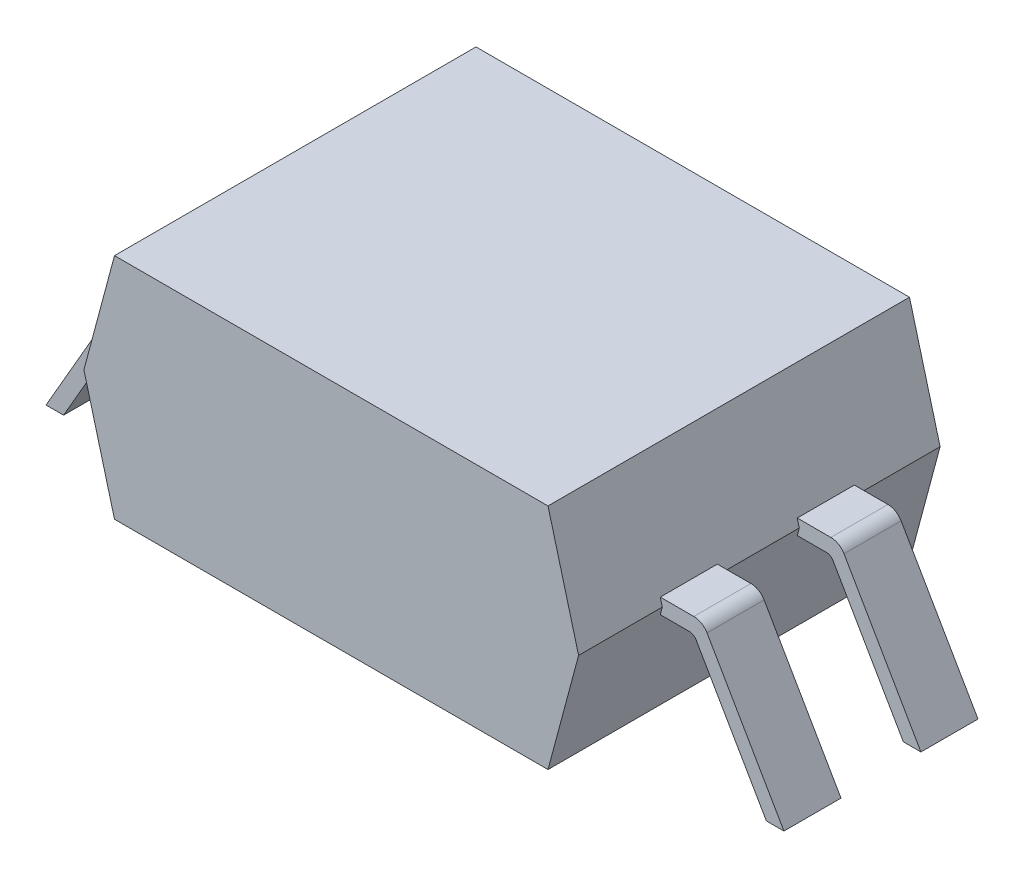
ISO-10303-21;
HEADER;
FILE_DESCRIPTION(('STEP AP214'),'2;1');
FILE_NAME('part.step','',(''),(''),'','','');
FILE_SCHEMA(('AUTOMOTIVE_DESIGN { 1 0 10303 214 1 1 1 1 }'));
ENDSEC;
DATA;
#1=APPLICATION_CONTEXT('core data for automotive mechanical design processes');
#2=APPLICATION_PROTOCOL_DEFINITION('international standard','automotive_design',2000,#1);
#3=PRODUCT_CONTEXT('',#1,'mechanical');
#4=PRODUCT('Part','Part','',(#3));
#5=PRODUCT_RELATED_PRODUCT_CATEGORY('part','',(#4));
#6=PRODUCT_DEFINITION_FORMATION('','',#4);
#7=PRODUCT_DEFINITION_CONTEXT('part definition',#1,'design');
#8=PRODUCT_DEFINITION('design','',#6,#7);
#9=PRODUCT_DEFINITION_SHAPE('','',#8);
#10=(LENGTH_UNIT() NAMED_UNIT(*) SI_UNIT(.MILLI.,.METRE.));
#11=(NAMED_UNIT(*) PLANE_ANGLE_UNIT() SI_UNIT($,.RADIAN.));
#12=(NAMED_UNIT(*) SI_UNIT($,.STERADIAN.) SOLID_ANGLE_UNIT());
#13=UNCERTAINTY_MEASURE_WITH_UNIT(LENGTH_MEASURE(1.E-05),#10,'distance_accuracy_value','');
#14=(GEOMETRIC_REPRESENTATION_CONTEXT(3) GLOBAL_UNCERTAINTY_ASSIGNED_CONTEXT((#13)) GLOBAL_UNIT_ASSIGNED_CONTEXT((#10,
#11,#12)) REPRESENTATION_CONTEXT('',''));
#15=CARTESIAN_POINT('',(0.,0.,0.));
#16=DIRECTION('',(0.,0.,1.));
#17=DIRECTION('',(1.,0.,0.));
#18=AXIS2_PLACEMENT_3D('',#15,#16,#17);
#19=CARTESIAN_POINT('',(-2.84807621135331,-1.50000000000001,2.375));
#20=DIRECTION('',(0.965925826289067,0.258819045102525,0.));
#21=DIRECTION('',(-0.258819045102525,0.965925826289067,0.));
#22=AXIS2_PLACEMENT_3D('',#19,#20,#21);
#23=PLANE('',#22);
#24=DIRECTION('',(0.,0.,1.));
#25=VECTOR('',#24,1.);
#26=CARTESIAN_POINT('',(-3.22320508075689,-0.1,-1.275));
#27=LINE('',#26,#25);
#28=CARTESIAN_POINT('',(-3.22320508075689,-0.1,-1.275));
#29=VERTEX_POINT('',#28);
#30=CARTESIAN_POINT('',(-3.22320508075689,-0.100000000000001,-0.525));
#31=VERTEX_POINT('',#30);
#32=EDGE_CURVE('E35',#29,#31,#27,.T.);
#33=ORIENTED_EDGE('',*,*,#32,.F.);
#34=DIRECTION('',(-0.258819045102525,0.965925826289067,0.));
#35=VECTOR('',#34,1.);
#36=CARTESIAN_POINT('',(-2.84807621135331,-1.50000000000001,-1.275));
#37=LINE('',#36,#35);
#38=CARTESIAN_POINT('',(-3.25,0.,-1.275));
#39=VERTEX_POINT('',#38);
#40=EDGE_CURVE('E11',#29,#39,#37,.T.);
#41=ORIENTED_EDGE('',*,*,#40,.T.);
#42=DIRECTION('',(0.,0.,-1.));
#43=VECTOR('',#42,1.);
#44=CARTESIAN_POINT('',(-3.25,0.,2.375));
#45=LINE('',#44,#43);
#46=CARTESIAN_POINT('',(-3.25,0.,-2.375));
#47=VERTEX_POINT('',#46);
#48=EDGE_CURVE('E27',#39,#47,#45,.T.);
#49=ORIENTED_EDGE('',*,*,#48,.T.);
#50=DIRECTION('',(0.258819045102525,-0.965925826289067,0.));
#51=VECTOR('',#50,1.);
#52=CARTESIAN_POINT('',(-2.84807621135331,-1.50000000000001,-2.375));
#53=LINE('',#52,#51);
#54=CARTESIAN_POINT('',(-2.84807621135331,-1.50000000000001,-2.375));
#55=VERTEX_POINT('',#54);
#56=EDGE_CURVE('E621',#47,#55,#53,.T.);
#57=ORIENTED_EDGE('',*,*,#56,.T.);
#58=DIRECTION('',(0.,0.,-1.));
#59=VECTOR('',#58,1.);
#60=CARTESIAN_POINT('',(-2.84807621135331,-1.50000000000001,2.375));
#61=LINE('',#60,#59);
#62=CARTESIAN_POINT('',(-2.84807621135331,-1.50000000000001,2.375));
#63=VERTEX_POINT('',#62);
#64=EDGE_CURVE('E600',#63,#55,#61,.T.);
#65=ORIENTED_EDGE('',*,*,#64,.F.);
#66=DIRECTION('',(0.258819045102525,-0.965925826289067,0.));
#67=VECTOR('',#66,1.);
#68=CARTESIAN_POINT('',(-2.84807621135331,-1.50000000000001,2.375));
#69=LINE('',#68,#67);
#70=CARTESIAN_POINT('',(-3.25,0.,2.375));
#71=VERTEX_POINT('',#70);
#72=EDGE_CURVE('E533',#71,#63,#69,.T.);
#73=ORIENTED_EDGE('',*,*,#72,.F.);
#74=DIRECTION('',(0.,0.,-1.));
#75=VECTOR('',#74,1.);
#76=CARTESIAN_POINT('',(-3.25,0.,2.375));
#77=LINE('',#76,#75);
#78=CARTESIAN_POINT('',(-3.25,0.,1.275));
#79=VERTEX_POINT('',#78);
#80=EDGE_CURVE('E618',#71,#79,#77,.T.);
#81=ORIENTED_EDGE('',*,*,#80,.T.);
#82=DIRECTION('',(0.258819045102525,-0.965925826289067,0.));
#83=VECTOR('',#82,1.);
#84=CARTESIAN_POINT('',(-2.84807621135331,-1.50000000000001,1.275));
#85=LINE('',#84,#83);
#86=CARTESIAN_POINT('',(-3.22320508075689,-0.1,1.275));
#87=VERTEX_POINT('',#86);
#88=EDGE_CURVE('E615',#79,#87,#85,.T.);
#89=ORIENTED_EDGE('',*,*,#88,.T.);
#90=DIRECTION('',(0.,0.,-1.));
#91=VECTOR('',#90,1.);
#92=CARTESIAN_POINT('',(-3.22320508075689,-0.1,1.275));
#93=LINE('',#92,#91);
#94=CARTESIAN_POINT('',(-3.22320508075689,-0.100000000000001,0.525));
#95=VERTEX_POINT('',#94);
#96=EDGE_CURVE('E611',#87,#95,#93,.T.);
#97=ORIENTED_EDGE('',*,*,#96,.T.);
#98=DIRECTION('',(0.258819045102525,-0.965925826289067,0.));
#99=VECTOR('',#98,1.);
#100=CARTESIAN_POINT('',(-2.84807621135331,-1.50000000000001,0.525));
#101=LINE('',#100,#99);
#102=CARTESIAN_POINT('',(-3.25,0.,0.525));
#103=VERTEX_POINT('',#102);
#104=EDGE_CURVE('E497',#103,#95,#101,.T.);
#105=ORIENTED_EDGE('',*,*,#104,.F.);
#106=DIRECTION('',(0.,0.,-1.));
#107=VECTOR('',#106,1.);
#108=CARTESIAN_POINT('',(-3.25,0.,2.375));
#109=LINE('',#108,#107);
#110=CARTESIAN_POINT('',(-3.25,0.,-0.525));
#111=VERTEX_POINT('',#110);
#112=EDGE_CURVE('E607',#103,#111,#109,.T.);
#113=ORIENTED_EDGE('',*,*,#112,.T.);
#114=DIRECTION('',(-0.258819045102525,0.965925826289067,0.));
#115=VECTOR('',#114,1.);
#116=CARTESIAN_POINT('',(-2.84807621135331,-1.50000000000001,-0.525));
#117=LINE('',#116,#115);
#118=EDGE_CURVE('E437',#31,#111,#117,.T.);
#119=ORIENTED_EDGE('',*,*,#118,.F.);
#120=EDGE_LOOP('',(#33,#41,#49,#57,#65,#73,#81,#89,#97,#105,#113,#119));
#121=FACE_BOUND('',#120,.T.);
#122=ADVANCED_FACE('F17',(#121),#23,.F.);
#123=CARTESIAN_POINT('',(-2.84807621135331,-1.50000000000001,2.375));
#124=DIRECTION('',(0.,1.,0.));
#125=DIRECTION('',(0.,0.,1.));
#126=AXIS2_PLACEMENT_3D('',#123,#124,#125);
#127=PLANE('',#126);
#128=DIRECTION('',(1.,0.,0.));
#129=VECTOR('',#128,1.);
#130=CARTESIAN_POINT('',(-2.84807621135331,-1.50000000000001,-2.375));
#131=LINE('',#130,#129);
#132=CARTESIAN_POINT('',(2.84807621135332,-1.50000000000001,-2.375));
#133=VERTEX_POINT('',#132);
#134=EDGE_CURVE('E604',#55,#133,#131,.T.);
#135=ORIENTED_EDGE('',*,*,#134,.T.);
#136=DIRECTION('',(0.,0.,-1.));
#137=VECTOR('',#136,1.);
#138=CARTESIAN_POINT('',(2.84807621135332,-1.50000000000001,2.375));
#139=LINE('',#138,#137);
#140=CARTESIAN_POINT('',(2.84807621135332,-1.50000000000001,2.375));
#141=VERTEX_POINT('',#140);
#142=EDGE_CURVE('E582',#141,#133,#139,.T.);
#143=ORIENTED_EDGE('',*,*,#142,.F.);
#144=DIRECTION('',(1.,0.,0.));
#145=VECTOR('',#144,1.);
#146=CARTESIAN_POINT('',(-2.84807621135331,-1.50000000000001,2.375));
#147=LINE('',#146,#145);
#148=EDGE_CURVE('E584',#63,#141,#147,.T.);
#149=ORIENTED_EDGE('',*,*,#148,.F.);
#150=ORIENTED_EDGE('',*,*,#64,.T.);
#151=EDGE_LOOP('',(#135,#143,#149,#150));
#152=FACE_BOUND('',#151,.T.);
#153=ADVANCED_FACE('F660',(#152),#127,.F.);
#154=CARTESIAN_POINT('',(2.84807621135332,-1.50000000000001,2.375));
#155=DIRECTION('',(-0.965925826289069,0.258819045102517,0.));
#156=DIRECTION('',(-0.258819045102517,-0.965925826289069,0.));
#157=AXIS2_PLACEMENT_3D('',#154,#155,#156);
#158=PLANE('',#157);
#159=DIRECTION('',(0.,0.,-1.));
#160=VECTOR('',#159,1.);
#161=CARTESIAN_POINT('',(3.25,0.,2.375));
#162=LINE('',#161,#160);
#163=CARTESIAN_POINT('',(3.25,0.,-1.275));
#164=VERTEX_POINT('',#163);
#165=CARTESIAN_POINT('',(3.25,0.,-2.375));
#166=VERTEX_POINT('',#165);
#167=EDGE_CURVE('E574',#164,#166,#162,.T.);
#168=ORIENTED_EDGE('',*,*,#167,.F.);
#169=DIRECTION('',(-0.258819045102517,-0.965925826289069,0.));
#170=VECTOR('',#169,1.);
#171=CARTESIAN_POINT('',(2.84807621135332,-1.50000000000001,-1.275));
#172=LINE('',#171,#170);
#173=CARTESIAN_POINT('',(3.22320508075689,-0.1,-1.275));
#174=VERTEX_POINT('',#173);
#175=EDGE_CURVE('E597',#164,#174,#172,.T.);
#176=ORIENTED_EDGE('',*,*,#175,.T.);
#177=DIRECTION('',(0.,0.,1.));
#178=VECTOR('',#177,1.);
#179=CARTESIAN_POINT('',(3.22320508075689,-0.1,-1.275));
#180=LINE('',#179,#178);
#181=CARTESIAN_POINT('',(3.22320508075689,-0.100000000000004,-0.525));
#182=VERTEX_POINT('',#181);
#183=EDGE_CURVE('E589',#174,#182,#180,.T.);
#184=ORIENTED_EDGE('',*,*,#183,.T.);
#185=DIRECTION('',(-0.258819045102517,-0.965925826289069,0.));
#186=VECTOR('',#185,1.);
#187=CARTESIAN_POINT('',(2.84807621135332,-1.50000000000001,-0.525));
#188=LINE('',#187,#186);
#189=CARTESIAN_POINT('',(3.25,0.,-0.525));
#190=VERTEX_POINT('',#189);
#191=EDGE_CURVE('E323',#190,#182,#188,.T.);
#192=ORIENTED_EDGE('',*,*,#191,.F.);
#193=DIRECTION('',(0.,0.,-1.));
#194=VECTOR('',#193,1.);
#195=CARTESIAN_POINT('',(3.25,0.,2.375));
#196=LINE('',#195,#194);
#197=CARTESIAN_POINT('',(3.25,0.,0.525));
#198=VERTEX_POINT('',#197);
#199=EDGE_CURVE('E557',#198,#190,#196,.T.);
#200=ORIENTED_EDGE('',*,*,#199,.F.);
#201=DIRECTION('',(0.258819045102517,0.965925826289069,0.));
#202=VECTOR('',#201,1.);
#203=CARTESIAN_POINT('',(2.84807621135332,-1.50000000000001,0.525));
#204=LINE('',#203,#202);
#205=CARTESIAN_POINT('',(3.22320508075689,-0.100000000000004,0.525));
#206=VERTEX_POINT('',#205);
#207=EDGE_CURVE('E378',#206,#198,#204,.T.);
#208=ORIENTED_EDGE('',*,*,#207,.F.);
#209=DIRECTION('',(0.,0.,-1.));
#210=VECTOR('',#209,1.);
#211=CARTESIAN_POINT('',(3.22320508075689,-0.1,1.275));
#212=LINE('',#211,#210);
#213=CARTESIAN_POINT('',(3.22320508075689,-0.1,1.275));
#214=VERTEX_POINT('',#213);
#215=EDGE_CURVE('E399',#214,#206,#212,.T.);
#216=ORIENTED_EDGE('',*,*,#215,.F.);
#217=DIRECTION('',(0.258819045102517,0.965925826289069,0.));
#218=VECTOR('',#217,1.);
#219=CARTESIAN_POINT('',(2.84807621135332,-1.50000000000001,1.275));
#220=LINE('',#219,#218);
#221=CARTESIAN_POINT('',(3.25,0.,1.275));
#222=VERTEX_POINT('',#221);
#223=EDGE_CURVE('E586',#214,#222,#220,.T.);
#224=ORIENTED_EDGE('',*,*,#223,.T.);
#225=DIRECTION('',(0.,0.,-1.));
#226=VECTOR('',#225,1.);
#227=CARTESIAN_POINT('',(3.25,0.,2.375));
#228=LINE('',#227,#226);
#229=CARTESIAN_POINT('',(3.25,0.,2.375));
#230=VERTEX_POINT('',#229);
#231=EDGE_CURVE('E567',#230,#222,#228,.T.);
#232=ORIENTED_EDGE('',*,*,#231,.F.);
#233=DIRECTION('',(0.258819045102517,0.965925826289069,0.));
#234=VECTOR('',#233,1.);
#235=CARTESIAN_POINT('',(2.84807621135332,-1.50000000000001,2.375));
#236=LINE('',#235,#234);
#237=EDGE_CURVE('E569',#141,#230,#236,.T.);
#238=ORIENTED_EDGE('',*,*,#237,.F.);
#239=ORIENTED_EDGE('',*,*,#142,.T.);
#240=DIRECTION('',(0.258819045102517,0.965925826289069,0.));
#241=VECTOR('',#240,1.);
#242=CARTESIAN_POINT('',(2.84807621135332,-1.50000000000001,-2.375));
#243=LINE('',#242,#241);
#244=EDGE_CURVE('E578',#133,#166,#243,.T.);
#245=ORIENTED_EDGE('',*,*,#244,.T.);
#246=EDGE_LOOP('',(#168,#176,#184,#192,#200,#208,#216,#224,#232,#238,#239,#245));
#247=FACE_BOUND('',#246,.T.);
#248=ADVANCED_FACE('F677',(#247),#158,.F.);
#249=CARTESIAN_POINT('',(2.84807621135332,1.50000000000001,2.375));
#250=DIRECTION('',(-0.965925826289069,-0.258819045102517,0.));
#251=DIRECTION('',(0.258819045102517,-0.965925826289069,0.));
#252=AXIS2_PLACEMENT_3D('',#249,#250,#251);
#253=PLANE('',#252);
#254=DIRECTION('',(0.,0.,1.));
#255=VECTOR('',#254,1.);
#256=CARTESIAN_POINT('',(3.22320508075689,0.1,-1.275));
#257=LINE('',#256,#255);
#258=CARTESIAN_POINT('',(3.22320508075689,0.1,-1.275));
#259=VERTEX_POINT('',#258);
#260=CARTESIAN_POINT('',(3.22320508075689,0.1,-0.525));
#261=VERTEX_POINT('',#260);
#262=EDGE_CURVE('E317',#259,#261,#257,.T.);
#263=ORIENTED_EDGE('',*,*,#262,.F.);
#264=DIRECTION('',(0.258819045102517,-0.965925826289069,0.));
#265=VECTOR('',#264,1.);
#266=CARTESIAN_POINT('',(2.84807621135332,1.50000000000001,-1.275));
#267=LINE('',#266,#265);
#268=EDGE_CURVE('E575',#259,#164,#267,.T.);
#269=ORIENTED_EDGE('',*,*,#268,.T.);
#270=ORIENTED_EDGE('',*,*,#167,.T.);
#271=DIRECTION('',(-0.258819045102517,0.965925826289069,0.));
#272=VECTOR('',#271,1.);
#273=CARTESIAN_POINT('',(2.84807621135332,1.50000000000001,-2.375));
#274=LINE('',#273,#272);
#275=CARTESIAN_POINT('',(2.84807621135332,1.50000000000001,-2.375));
#276=VERTEX_POINT('',#275);
#277=EDGE_CURVE('E571',#166,#276,#274,.T.);
#278=ORIENTED_EDGE('',*,*,#277,.T.);
#279=DIRECTION('',(0.,0.,-1.));
#280=VECTOR('',#279,1.);
#281=CARTESIAN_POINT('',(2.84807621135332,1.50000000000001,2.375));
#282=LINE('',#281,#280);
#283=CARTESIAN_POINT('',(2.84807621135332,1.50000000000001,2.375));
#284=VERTEX_POINT('',#283);
#285=EDGE_CURVE('E550',#284,#276,#282,.T.);
#286=ORIENTED_EDGE('',*,*,#285,.F.);
#287=DIRECTION('',(-0.258819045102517,0.965925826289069,0.));
#288=VECTOR('',#287,1.);
#289=CARTESIAN_POINT('',(2.84807621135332,1.50000000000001,2.375));
#290=LINE('',#289,#288);
#291=EDGE_CURVE('E552',#230,#284,#290,.T.);
#292=ORIENTED_EDGE('',*,*,#291,.F.);
#293=ORIENTED_EDGE('',*,*,#231,.T.);
#294=DIRECTION('',(-0.258819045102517,0.965925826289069,0.));
#295=VECTOR('',#294,1.);
#296=CARTESIAN_POINT('',(2.84807621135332,1.50000000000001,1.275));
#297=LINE('',#296,#295);
#298=CARTESIAN_POINT('',(3.22320508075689,0.1,1.275));
#299=VERTEX_POINT('',#298);
#300=EDGE_CURVE('E564',#222,#299,#297,.T.);
#301=ORIENTED_EDGE('',*,*,#300,.T.);
#302=DIRECTION('',(0.,0.,-1.));
#303=VECTOR('',#302,1.);
#304=CARTESIAN_POINT('',(3.22320508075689,0.1,1.275));
#305=LINE('',#304,#303);
#306=CARTESIAN_POINT('',(3.22320508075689,0.1,0.525));
#307=VERTEX_POINT('',#306);
#308=EDGE_CURVE('E561',#299,#307,#305,.T.);
#309=ORIENTED_EDGE('',*,*,#308,.T.);
#310=DIRECTION('',(-0.258819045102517,0.965925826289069,0.));
#311=VECTOR('',#310,1.);
#312=CARTESIAN_POINT('',(2.84807621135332,1.50000000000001,0.525));
#313=LINE('',#312,#311);
#314=EDGE_CURVE('E372',#198,#307,#313,.T.);
#315=ORIENTED_EDGE('',*,*,#314,.F.);
#316=ORIENTED_EDGE('',*,*,#199,.T.);
#317=DIRECTION('',(0.258819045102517,-0.965925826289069,0.));
#318=VECTOR('',#317,1.);
#319=CARTESIAN_POINT('',(2.84807621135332,1.50000000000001,-0.525));
#320=LINE('',#319,#318);
#321=EDGE_CURVE('E331',#261,#190,#320,.T.);
#322=ORIENTED_EDGE('',*,*,#321,.F.);
#323=EDGE_LOOP('',(#263,#269,#270,#278,#286,#292,#293,#301,#309,#315,#316,#322));
#324=FACE_BOUND('',#323,.T.);
#325=ADVANCED_FACE('F673',(#324),#253,.F.);
#326=CARTESIAN_POINT('',(-2.84807621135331,1.50000000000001,2.375));
#327=DIRECTION('',(0.,-1.,0.));
#328=DIRECTION('',(0.,0.,-1.));
#329=AXIS2_PLACEMENT_3D('',#326,#327,#328);
#330=PLANE('',#329);
#331=DIRECTION('',(-1.,0.,0.));
#332=VECTOR('',#331,1.);
#333=CARTESIAN_POINT('',(-2.84807621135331,1.50000000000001,-2.375));
#334=LINE('',#333,#332);
#335=CARTESIAN_POINT('',(-2.84807621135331,1.50000000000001,-2.375));
#336=VERTEX_POINT('',#335);
#337=EDGE_CURVE('E554',#276,#336,#334,.T.);
#338=ORIENTED_EDGE('',*,*,#337,.T.);
#339=DIRECTION('',(0.,0.,-1.));
#340=VECTOR('',#339,1.);
#341=CARTESIAN_POINT('',(-2.84807621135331,1.50000000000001,2.375));
#342=LINE('',#341,#340);
#343=CARTESIAN_POINT('',(-2.84807621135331,1.50000000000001,2.375));
#344=VERTEX_POINT('',#343);
#345=EDGE_CURVE('E532',#344,#336,#342,.T.);
#346=ORIENTED_EDGE('',*,*,#345,.F.);
#347=DIRECTION('',(-1.,0.,0.));
#348=VECTOR('',#347,1.);
#349=CARTESIAN_POINT('',(-2.84807621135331,1.50000000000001,2.375));
#350=LINE('',#349,#348);
#351=EDGE_CURVE('E536',#284,#344,#350,.T.);
#352=ORIENTED_EDGE('',*,*,#351,.F.);
#353=ORIENTED_EDGE('',*,*,#285,.T.);
#354=EDGE_LOOP('',(#338,#346,#352,#353));
#355=FACE_BOUND('',#354,.T.);
#356=ADVANCED_FACE('F671',(#355),#330,.F.);
#357=CARTESIAN_POINT('',(-2.84807621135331,1.50000000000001,2.375));
#358=DIRECTION('',(0.965925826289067,-0.258819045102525,0.));
#359=DIRECTION('',(0.258819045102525,0.965925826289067,0.));
#360=AXIS2_PLACEMENT_3D('',#357,#358,#359);
#361=PLANE('',#360);
#362=ORIENTED_EDGE('',*,*,#48,.F.);
#363=DIRECTION('',(0.258819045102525,0.965925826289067,0.));
#364=VECTOR('',#363,1.);
#365=CARTESIAN_POINT('',(-2.84807621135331,1.50000000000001,-1.275));
#366=LINE('',#365,#364);
#367=CARTESIAN_POINT('',(-3.22320508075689,0.1,-1.275));
#368=VERTEX_POINT('',#367);
#369=EDGE_CURVE('E547',#39,#368,#366,.T.);
#370=ORIENTED_EDGE('',*,*,#369,.T.);
#371=DIRECTION('',(0.,0.,1.));
#372=VECTOR('',#371,1.);
#373=CARTESIAN_POINT('',(-3.22320508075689,0.1,-1.275));
#374=LINE('',#373,#372);
#375=CARTESIAN_POINT('',(-3.22320508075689,0.1,-0.525));
#376=VERTEX_POINT('',#375);
#377=EDGE_CURVE('E540',#368,#376,#374,.T.);
#378=ORIENTED_EDGE('',*,*,#377,.T.);
#379=DIRECTION('',(0.258819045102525,0.965925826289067,0.));
#380=VECTOR('',#379,1.);
#381=CARTESIAN_POINT('',(-2.84807621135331,1.50000000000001,-0.525));
#382=LINE('',#381,#380);
#383=EDGE_CURVE('E431',#111,#376,#382,.T.);
#384=ORIENTED_EDGE('',*,*,#383,.F.);
#385=ORIENTED_EDGE('',*,*,#112,.F.);
#386=DIRECTION('',(-0.258819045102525,-0.965925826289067,0.));
#387=VECTOR('',#386,1.);
#388=CARTESIAN_POINT('',(-2.84807621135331,1.50000000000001,0.525));
#389=LINE('',#388,#387);
#390=CARTESIAN_POINT('',(-3.22320508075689,0.1,0.525));
#391=VERTEX_POINT('',#390);
#392=EDGE_CURVE('E505',#391,#103,#389,.T.);
#393=ORIENTED_EDGE('',*,*,#392,.F.);
#394=DIRECTION('',(0.,0.,-1.));
#395=VECTOR('',#394,1.);
#396=CARTESIAN_POINT('',(-3.22320508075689,0.1,1.275));
#397=LINE('',#396,#395);
#398=CARTESIAN_POINT('',(-3.22320508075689,0.1,1.275));
#399=VERTEX_POINT('',#398);
#400=EDGE_CURVE('E485',#399,#391,#397,.T.);
#401=ORIENTED_EDGE('',*,*,#400,.F.);
#402=DIRECTION('',(-0.258819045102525,-0.965925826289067,0.));
#403=VECTOR('',#402,1.);
#404=CARTESIAN_POINT('',(-2.84807621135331,1.50000000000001,1.275));
#405=LINE('',#404,#403);
#406=EDGE_CURVE('E537',#399,#79,#405,.T.);
#407=ORIENTED_EDGE('',*,*,#406,.T.);
#408=ORIENTED_EDGE('',*,*,#80,.F.);
#409=DIRECTION('',(-0.258819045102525,-0.965925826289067,0.));
#410=VECTOR('',#409,1.);
#411=CARTESIAN_POINT('',(-2.84807621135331,1.50000000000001,2.375));
#412=LINE('',#411,#410);
#413=EDGE_CURVE('E528',#344,#71,#412,.T.);
#414=ORIENTED_EDGE('',*,*,#413,.F.);
#415=ORIENTED_EDGE('',*,*,#345,.T.);
#416=DIRECTION('',(-0.258819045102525,-0.965925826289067,0.));
#417=VECTOR('',#416,1.);
#418=CARTESIAN_POINT('',(-2.84807621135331,1.50000000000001,-2.375));
#419=LINE('',#418,#417);
#420=EDGE_CURVE('E529',#336,#47,#419,.T.);
#421=ORIENTED_EDGE('',*,*,#420,.T.);
#422=EDGE_LOOP('',(#362,#370,#378,#384,#385,#393,#401,#407,#408,#414,#415,#421));
#423=FACE_BOUND('',#422,.T.);
#424=ADVANCED_FACE('F650',(#423),#361,.F.);
#425=CARTESIAN_POINT('',(-3.65192378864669,1.50000000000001,2.375));
#426=DIRECTION('',(0.,0.,-1.));
#427=DIRECTION('',(-1.,0.,0.));
#428=AXIS2_PLACEMENT_3D('',#425,#426,#427);
#429=PLANE('',#428);
#430=ORIENTED_EDGE('',*,*,#72,.T.);
#431=ORIENTED_EDGE('',*,*,#148,.T.);
#432=ORIENTED_EDGE('',*,*,#237,.T.);
#433=ORIENTED_EDGE('',*,*,#291,.T.);
#434=ORIENTED_EDGE('',*,*,#351,.T.);
#435=ORIENTED_EDGE('',*,*,#413,.T.);
#436=EDGE_LOOP('',(#430,#431,#432,#433,#434,#435));
#437=FACE_BOUND('',#436,.T.);
#438=ADVANCED_FACE('F666',(#437),#429,.F.);
#439=CARTESIAN_POINT('',(-3.65192378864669,1.50000000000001,-2.375));
#440=DIRECTION('',(0.,0.,-1.));
#441=DIRECTION('',(-1.,0.,0.));
#442=AXIS2_PLACEMENT_3D('',#439,#440,#441);
#443=PLANE('',#442);
#444=ORIENTED_EDGE('',*,*,#56,.F.);
#445=ORIENTED_EDGE('',*,*,#420,.F.);
#446=ORIENTED_EDGE('',*,*,#337,.F.);
#447=ORIENTED_EDGE('',*,*,#277,.F.);
#448=ORIENTED_EDGE('',*,*,#244,.F.);
#449=ORIENTED_EDGE('',*,*,#134,.F.);
#450=EDGE_LOOP('',(#444,#445,#446,#447,#448,#449));
#451=FACE_BOUND('',#450,.T.);
#452=ADVANCED_FACE('F655',(#451),#443,.T.);
#453=CARTESIAN_POINT('',(-3.22320508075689,-1.75000000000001,1.275));
#454=DIRECTION('',(0.,0.,1.));
#455=DIRECTION('',(1.,0.,0.));
#456=AXIS2_PLACEMENT_3D('',#453,#454,#455);
#457=PLANE('',#456);
#458=DIRECTION('',(-1.,0.,0.));
#459=VECTOR('',#458,1.);
#460=CARTESIAN_POINT('',(-3.22320508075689,0.1,1.275));
#461=LINE('',#460,#459);
#462=CARTESIAN_POINT('',(-3.66450815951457,0.1,1.275));
#463=VERTEX_POINT('',#462);
#464=EDGE_CURVE('E525',#399,#463,#461,.T.);
#465=ORIENTED_EDGE('',*,*,#464,.T.);
#466=CARTESIAN_POINT('',(-3.66450815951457,-0.1,1.275));
#467=DIRECTION('',(0.,0.,1.));
#468=DIRECTION('',(1.,0.,0.));
#469=AXIS2_PLACEMENT_3D('',#466,#467,#468);
#470=CIRCLE('',#469,0.2);
#471=CARTESIAN_POINT('',(-3.83771324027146,0.,1.275));
#472=VERTEX_POINT('',#471);
#473=EDGE_CURVE('E522',#463,#472,#470,.T.);
#474=ORIENTED_EDGE('',*,*,#473,.T.);
#475=DIRECTION('',(-0.499999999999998,-0.86602540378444,0.));
#476=VECTOR('',#475,1.);
#477=CARTESIAN_POINT('',(-3.7799782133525,0.0999999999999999,1.275));
#478=LINE('',#477,#476);
#479=CARTESIAN_POINT('',(-4.84807621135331,-1.75000000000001,1.275));
#480=VERTEX_POINT('',#479);
#481=EDGE_CURVE('E519',#472,#480,#478,.T.);
#482=ORIENTED_EDGE('',*,*,#481,.T.);
#483=DIRECTION('',(1.,0.,0.));
#484=VECTOR('',#483,1.);
#485=CARTESIAN_POINT('',(-4.84807621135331,-1.75000000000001,1.275));
#486=LINE('',#485,#484);
#487=CARTESIAN_POINT('',(-4.61713610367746,-1.75000000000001,1.275));
#488=VERTEX_POINT('',#487);
#489=EDGE_CURVE('E516',#480,#488,#486,.T.);
#490=ORIENTED_EDGE('',*,*,#489,.T.);
#491=DIRECTION('',(0.499999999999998,0.86602540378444,0.));
#492=VECTOR('',#491,1.);
#493=CARTESIAN_POINT('',(-3.66450815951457,-0.1,1.275));
#494=LINE('',#493,#492);
#495=CARTESIAN_POINT('',(-3.69337567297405,-0.15,1.275));
#496=VERTEX_POINT('',#495);
#497=EDGE_CURVE('E513',#488,#496,#494,.T.);
#498=ORIENTED_EDGE('',*,*,#497,.T.);
#499=CARTESIAN_POINT('',(-3.60677313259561,-0.2,1.275));
#500=DIRECTION('',(0.,0.,-1.));
#501=DIRECTION('',(1.,0.,0.));
#502=AXIS2_PLACEMENT_3D('',#499,#500,#501);
#503=CIRCLE('',#502,0.0999999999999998);
#504=CARTESIAN_POINT('',(-3.60677313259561,-0.1,1.275));
#505=VERTEX_POINT('',#504);
#506=EDGE_CURVE('E510',#496,#505,#503,.T.);
#507=ORIENTED_EDGE('',*,*,#506,.T.);
#508=DIRECTION('',(1.,0.,0.));
#509=VECTOR('',#508,1.);
#510=CARTESIAN_POINT('',(-3.22320508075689,-0.1,1.275));
#511=LINE('',#510,#509);
#512=EDGE_CURVE('E504',#505,#87,#511,.T.);
#513=ORIENTED_EDGE('',*,*,#512,.T.);
#514=ORIENTED_EDGE('',*,*,#88,.F.);
#515=ORIENTED_EDGE('',*,*,#406,.F.);
#516=EDGE_LOOP('',(#465,#474,#482,#490,#498,#507,#513,#514,#515));
#517=FACE_BOUND('',#516,.T.);
#518=ADVANCED_FACE('F737',(#517),#457,.T.);
#519=CARTESIAN_POINT('',(-3.22320508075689,-1.75000000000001,0.525));
#520=DIRECTION('',(0.,0.,1.));
#521=DIRECTION('',(1.,0.,0.));
#522=AXIS2_PLACEMENT_3D('',#519,#520,#521);
#523=PLANE('',#522);
#524=DIRECTION('',(-0.499999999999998,-0.86602540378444,0.));
#525=VECTOR('',#524,1.);
#526=CARTESIAN_POINT('',(-3.7799782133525,0.0999999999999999,0.525));
#527=LINE('',#526,#525);
#528=CARTESIAN_POINT('',(-3.83771324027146,0.,0.525));
#529=VERTEX_POINT('',#528);
#530=CARTESIAN_POINT('',(-4.84807621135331,-1.75000000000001,0.525));
#531=VERTEX_POINT('',#530);
#532=EDGE_CURVE('E486',#529,#531,#527,.T.);
#533=ORIENTED_EDGE('',*,*,#532,.F.);
#534=CARTESIAN_POINT('',(-3.66450815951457,-0.1,0.525));
#535=DIRECTION('',(0.,0.,-1.));
#536=DIRECTION('',(1.,0.,0.));
#537=AXIS2_PLACEMENT_3D('',#534,#535,#536);
#538=CIRCLE('',#537,0.2);
#539=CARTESIAN_POINT('',(-3.66450815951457,0.1,0.525));
#540=VERTEX_POINT('',#539);
#541=EDGE_CURVE('E501',#529,#540,#538,.T.);
#542=ORIENTED_EDGE('',*,*,#541,.T.);
#543=DIRECTION('',(-1.,0.,0.));
#544=VECTOR('',#543,1.);
#545=CARTESIAN_POINT('',(-3.22320508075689,0.1,0.525));
#546=LINE('',#545,#544);
#547=EDGE_CURVE('E490',#391,#540,#546,.T.);
#548=ORIENTED_EDGE('',*,*,#547,.F.);
#549=ORIENTED_EDGE('',*,*,#392,.T.);
#550=ORIENTED_EDGE('',*,*,#104,.T.);
#551=DIRECTION('',(1.,0.,0.));
#552=VECTOR('',#551,1.);
#553=CARTESIAN_POINT('',(-3.22320508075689,-0.1,0.525));
#554=LINE('',#553,#552);
#555=CARTESIAN_POINT('',(-3.60677313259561,-0.1,0.525));
#556=VERTEX_POINT('',#555);
#557=EDGE_CURVE('E466',#556,#95,#554,.T.);
#558=ORIENTED_EDGE('',*,*,#557,.F.);
#559=CARTESIAN_POINT('',(-3.60677313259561,-0.2,0.525));
#560=DIRECTION('',(0.,0.,1.));
#561=DIRECTION('',(1.,0.,0.));
#562=AXIS2_PLACEMENT_3D('',#559,#560,#561);
#563=CIRCLE('',#562,0.0999999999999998);
#564=CARTESIAN_POINT('',(-3.69337567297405,-0.15,0.525));
#565=VERTEX_POINT('',#564);
#566=EDGE_CURVE('E494',#556,#565,#563,.T.);
#567=ORIENTED_EDGE('',*,*,#566,.T.);
#568=DIRECTION('',(0.499999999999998,0.86602540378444,0.));
#569=VECTOR('',#568,1.);
#570=CARTESIAN_POINT('',(-3.66450815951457,-0.1,0.525));
#571=LINE('',#570,#569);
#572=CARTESIAN_POINT('',(-4.61713610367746,-1.75000000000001,0.525));
#573=VERTEX_POINT('',#572);
#574=EDGE_CURVE('E475',#573,#565,#571,.T.);
#575=ORIENTED_EDGE('',*,*,#574,.F.);
#576=DIRECTION('',(1.,0.,0.));
#577=VECTOR('',#576,1.);
#578=CARTESIAN_POINT('',(-4.84807621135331,-1.75000000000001,0.525));
#579=LINE('',#578,#577);
#580=EDGE_CURVE('E481',#531,#573,#579,.T.);
#581=ORIENTED_EDGE('',*,*,#580,.F.);
#582=EDGE_LOOP('',(#533,#542,#548,#549,#550,#558,#567,#575,#581));
#583=FACE_BOUND('',#582,.T.);
#584=ADVANCED_FACE('F740',(#583),#523,.F.);
#585=CARTESIAN_POINT('',(-3.22320508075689,0.1,1.275));
#586=DIRECTION('',(0.,-1.,0.));
#587=DIRECTION('',(1.,0.,0.));
#588=AXIS2_PLACEMENT_3D('',#585,#586,#587);
#589=PLANE('',#588);
#590=ORIENTED_EDGE('',*,*,#547,.T.);
#591=DIRECTION('',(0.,0.,1.));
#592=VECTOR('',#591,1.);
#593=CARTESIAN_POINT('',(-3.66450815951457,0.1,1.275));
#594=LINE('',#593,#592);
#595=EDGE_CURVE('E487',#540,#463,#594,.T.);
#596=ORIENTED_EDGE('',*,*,#595,.T.);
#597=ORIENTED_EDGE('',*,*,#464,.F.);
#598=ORIENTED_EDGE('',*,*,#400,.T.);
#599=EDGE_LOOP('',(#590,#596,#597,#598));
#600=FACE_BOUND('',#599,.T.);
#601=ADVANCED_FACE('F744',(#600),#589,.F.);
#602=CARTESIAN_POINT('',(-3.7799782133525,0.0999999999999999,1.275));
#603=DIRECTION('',(0.86602540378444,-0.499999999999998,0.));
#604=DIRECTION('',(0.499999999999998,0.86602540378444,0.));
#605=AXIS2_PLACEMENT_3D('',#602,#603,#604);
#606=PLANE('',#605);
#607=ORIENTED_EDGE('',*,*,#481,.F.);
#608=DIRECTION('',(0.,0.,-1.));
#609=VECTOR('',#608,1.);
#610=CARTESIAN_POINT('',(-3.83771324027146,0.,1.275));
#611=LINE('',#610,#609);
#612=EDGE_CURVE('E482',#472,#529,#611,.T.);
#613=ORIENTED_EDGE('',*,*,#612,.T.);
#614=ORIENTED_EDGE('',*,*,#532,.T.);
#615=DIRECTION('',(0.,0.,-1.));
#616=VECTOR('',#615,1.);
#617=CARTESIAN_POINT('',(-4.84807621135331,-1.75000000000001,1.275));
#618=LINE('',#617,#616);
#619=EDGE_CURVE('E478',#480,#531,#618,.T.);
#620=ORIENTED_EDGE('',*,*,#619,.F.);
#621=EDGE_LOOP('',(#607,#613,#614,#620));
#622=FACE_BOUND('',#621,.T.);
#623=ADVANCED_FACE('F748',(#622),#606,.F.);
#624=CARTESIAN_POINT('',(-4.84807621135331,-1.75000000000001,1.275));
#625=DIRECTION('',(0.,1.,0.));
#626=DIRECTION('',(0.,0.,1.));
#627=AXIS2_PLACEMENT_3D('',#624,#625,#626);
#628=PLANE('',#627);
#629=ORIENTED_EDGE('',*,*,#580,.T.);
#630=DIRECTION('',(0.,0.,-1.));
#631=VECTOR('',#630,1.);
#632=CARTESIAN_POINT('',(-4.61713610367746,-1.75000000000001,1.275));
#633=LINE('',#632,#631);
#634=EDGE_CURVE('E471',#488,#573,#633,.T.);
#635=ORIENTED_EDGE('',*,*,#634,.F.);
#636=ORIENTED_EDGE('',*,*,#489,.F.);
#637=ORIENTED_EDGE('',*,*,#619,.T.);
#638=EDGE_LOOP('',(#629,#635,#636,#637));
#639=FACE_BOUND('',#638,.T.);
#640=ADVANCED_FACE('F752',(#639),#628,.F.);
#641=CARTESIAN_POINT('',(-3.66450815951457,-0.1,1.275));
#642=DIRECTION('',(-0.86602540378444,0.499999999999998,0.));
#643=DIRECTION('',(-0.499999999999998,-0.86602540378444,0.));
#644=AXIS2_PLACEMENT_3D('',#641,#642,#643);
#645=PLANE('',#644);
#646=ORIENTED_EDGE('',*,*,#574,.T.);
#647=DIRECTION('',(0.,0.,1.));
#648=VECTOR('',#647,1.);
#649=CARTESIAN_POINT('',(-3.69337567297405,-0.15,1.275));
#650=LINE('',#649,#648);
#651=EDGE_CURVE('E472',#565,#496,#650,.T.);
#652=ORIENTED_EDGE('',*,*,#651,.T.);
#653=ORIENTED_EDGE('',*,*,#497,.F.);
#654=ORIENTED_EDGE('',*,*,#634,.T.);
#655=EDGE_LOOP('',(#646,#652,#653,#654));
#656=FACE_BOUND('',#655,.T.);
#657=ADVANCED_FACE('F756',(#656),#645,.F.);
#658=CARTESIAN_POINT('',(-3.22320508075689,-0.1,1.275));
#659=DIRECTION('',(0.,1.,0.));
#660=DIRECTION('',(-1.,0.,0.));
#661=AXIS2_PLACEMENT_3D('',#658,#659,#660);
#662=PLANE('',#661);
#663=ORIENTED_EDGE('',*,*,#512,.F.);
#664=DIRECTION('',(0.,0.,-1.));
#665=VECTOR('',#664,1.);
#666=CARTESIAN_POINT('',(-3.60677313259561,-0.1,0.525));
#667=LINE('',#666,#665);
#668=EDGE_CURVE('E468',#505,#556,#667,.T.);
#669=ORIENTED_EDGE('',*,*,#668,.T.);
#670=ORIENTED_EDGE('',*,*,#557,.T.);
#671=ORIENTED_EDGE('',*,*,#96,.F.);
#672=EDGE_LOOP('',(#663,#669,#670,#671));
#673=FACE_BOUND('',#672,.T.);
#674=ADVANCED_FACE('F760',(#673),#662,.F.);
#675=CARTESIAN_POINT('',(-3.60677313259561,-0.2,1.275));
#676=DIRECTION('',(0.,0.,1.));
#677=DIRECTION('',(1.,0.,0.));
#678=AXIS2_PLACEMENT_3D('',#675,#676,#677);
#679=CYLINDRICAL_SURFACE('',#678,0.0999999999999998);
#680=ORIENTED_EDGE('',*,*,#506,.F.);
#681=ORIENTED_EDGE('',*,*,#651,.F.);
#682=ORIENTED_EDGE('',*,*,#566,.F.);
#683=ORIENTED_EDGE('',*,*,#668,.F.);
#684=EDGE_LOOP('',(#680,#681,#682,#683));
#685=FACE_BOUND('',#684,.T.);
#686=ADVANCED_FACE('F764',(#685),#679,.F.);
#687=CARTESIAN_POINT('',(-3.66450815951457,-0.1,1.275));
#688=DIRECTION('',(0.,0.,-1.));
#689=DIRECTION('',(-1.,0.,0.));
#690=AXIS2_PLACEMENT_3D('',#687,#688,#689);
#691=CYLINDRICAL_SURFACE('',#690,0.2);
#692=ORIENTED_EDGE('',*,*,#473,.F.);
#693=ORIENTED_EDGE('',*,*,#595,.F.);
#694=ORIENTED_EDGE('',*,*,#541,.F.);
#695=ORIENTED_EDGE('',*,*,#612,.F.);
#696=EDGE_LOOP('',(#692,#693,#694,#695));
#697=FACE_BOUND('',#696,.T.);
#698=ADVANCED_FACE('F768',(#697),#691,.T.);
#699=CARTESIAN_POINT('',(-3.22320508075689,-1.75000000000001,-1.275));
#700=DIRECTION('',(0.,0.,-1.));
#701=DIRECTION('',(1.,0.,0.));
#702=AXIS2_PLACEMENT_3D('',#699,#700,#701);
#703=PLANE('',#702);
#704=DIRECTION('',(-0.499999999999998,-0.86602540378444,0.));
#705=VECTOR('',#704,1.);
#706=CARTESIAN_POINT('',(-3.7799782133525,0.0999999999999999,-1.275));
#707=LINE('',#706,#705);
#708=CARTESIAN_POINT('',(-3.83771324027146,0.,-1.275));
#709=VERTEX_POINT('',#708);
#710=CARTESIAN_POINT('',(-4.84807621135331,-1.75000000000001,-1.275));
#711=VERTEX_POINT('',#710);
#712=EDGE_CURVE('E417',#709,#711,#707,.T.);
#713=ORIENTED_EDGE('',*,*,#712,.F.);
#714=CARTESIAN_POINT('',(-3.66450815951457,-0.1,-1.275));
#715=DIRECTION('',(0.,0.,-1.));
#716=DIRECTION('',(-1.,0.,0.));
#717=AXIS2_PLACEMENT_3D('',#714,#715,#716);
#718=CIRCLE('',#717,0.2);
#719=CARTESIAN_POINT('',(-3.66450815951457,0.1,-1.275));
#720=VERTEX_POINT('',#719);
#721=EDGE_CURVE('E460',#709,#720,#718,.T.);
#722=ORIENTED_EDGE('',*,*,#721,.T.);
#723=DIRECTION('',(-1.,0.,0.));
#724=VECTOR('',#723,1.);
#725=CARTESIAN_POINT('',(-3.22320508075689,0.1,-1.275));
#726=LINE('',#725,#724);
#727=EDGE_CURVE('E412',#368,#720,#726,.T.);
#728=ORIENTED_EDGE('',*,*,#727,.F.);
#729=ORIENTED_EDGE('',*,*,#369,.F.);
#730=ORIENTED_EDGE('',*,*,#40,.F.);
#731=DIRECTION('',(1.,0.,0.));
#732=VECTOR('',#731,1.);
#733=CARTESIAN_POINT('',(-3.22320508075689,-0.1,-1.275));
#734=LINE('',#733,#732);
#735=CARTESIAN_POINT('',(-3.60677313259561,-0.1,-1.275));
#736=VERTEX_POINT('',#735);
#737=EDGE_CURVE('E432',#736,#29,#734,.T.);
#738=ORIENTED_EDGE('',*,*,#737,.F.);
#739=CARTESIAN_POINT('',(-3.60677313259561,-0.2,-1.275));
#740=DIRECTION('',(0.,0.,1.));
#741=DIRECTION('',(-1.,0.,0.));
#742=AXIS2_PLACEMENT_3D('',#739,#740,#741);
#743=CIRCLE('',#742,0.0999999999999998);
#744=CARTESIAN_POINT('',(-3.69337567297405,-0.15,-1.275));
#745=VERTEX_POINT('',#744);
#746=EDGE_CURVE('E455',#736,#745,#743,.T.);
#747=ORIENTED_EDGE('',*,*,#746,.T.);
#748=DIRECTION('',(0.499999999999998,0.86602540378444,0.));
#749=VECTOR('',#748,1.);
#750=CARTESIAN_POINT('',(-3.66450815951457,-0.1,-1.275));
#751=LINE('',#750,#749);
#752=CARTESIAN_POINT('',(-4.61713610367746,-1.75000000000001,-1.275));
#753=VERTEX_POINT('',#752);
#754=EDGE_CURVE('E427',#753,#745,#751,.T.);
#755=ORIENTED_EDGE('',*,*,#754,.F.);
#756=DIRECTION('',(1.,0.,0.));
#757=VECTOR('',#756,1.);
#758=CARTESIAN_POINT('',(-4.84807621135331,-1.75000000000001,-1.275));
#759=LINE('',#758,#757);
#760=EDGE_CURVE('E423',#711,#753,#759,.T.);
#761=ORIENTED_EDGE('',*,*,#760,.F.);
#762=EDGE_LOOP('',(#713,#722,#728,#729,#730,#738,#747,#755,#761));
#763=FACE_BOUND('',#762,.T.);
#764=ADVANCED_FACE('F641',(#763),#703,.T.);
#765=CARTESIAN_POINT('',(-3.22320508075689,-1.75000000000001,-0.525));
#766=DIRECTION('',(0.,0.,-1.));
#767=DIRECTION('',(1.,0.,0.));
#768=AXIS2_PLACEMENT_3D('',#765,#766,#767);
#769=PLANE('',#768);
#770=DIRECTION('',(-1.,0.,0.));
#771=VECTOR('',#770,1.);
#772=CARTESIAN_POINT('',(-3.22320508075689,0.1,-0.525));
#773=LINE('',#772,#771);
#774=CARTESIAN_POINT('',(-3.66450815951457,0.1,-0.525));
#775=VERTEX_POINT('',#774);
#776=EDGE_CURVE('E452',#376,#775,#773,.T.);
#777=ORIENTED_EDGE('',*,*,#776,.T.);
#778=CARTESIAN_POINT('',(-3.66450815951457,-0.1,-0.525));
#779=DIRECTION('',(0.,0.,1.));
#780=DIRECTION('',(-1.,0.,0.));
#781=AXIS2_PLACEMENT_3D('',#778,#779,#780);
#782=CIRCLE('',#781,0.2);
#783=CARTESIAN_POINT('',(-3.83771324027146,0.,-0.525));
#784=VERTEX_POINT('',#783);
#785=EDGE_CURVE('E449',#775,#784,#782,.T.);
#786=ORIENTED_EDGE('',*,*,#785,.T.);
#787=DIRECTION('',(-0.499999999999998,-0.86602540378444,0.));
#788=VECTOR('',#787,1.);
#789=CARTESIAN_POINT('',(-3.7799782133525,0.0999999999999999,-0.525));
#790=LINE('',#789,#788);
#791=CARTESIAN_POINT('',(-4.84807621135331,-1.75000000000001,-0.525));
#792=VERTEX_POINT('',#791);
#793=EDGE_CURVE('E446',#784,#792,#790,.T.);
#794=ORIENTED_EDGE('',*,*,#793,.T.);
#795=DIRECTION('',(1.,0.,0.));
#796=VECTOR('',#795,1.);
#797=CARTESIAN_POINT('',(-4.84807621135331,-1.75000000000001,-0.525));
#798=LINE('',#797,#796);
#799=CARTESIAN_POINT('',(-4.61713610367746,-1.75000000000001,-0.525));
#800=VERTEX_POINT('',#799);
#801=EDGE_CURVE('E443',#792,#800,#798,.T.);
#802=ORIENTED_EDGE('',*,*,#801,.T.);
#803=DIRECTION('',(0.499999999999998,0.86602540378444,0.));
#804=VECTOR('',#803,1.);
#805=CARTESIAN_POINT('',(-3.66450815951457,-0.1,-0.525));
#806=LINE('',#805,#804);
#807=CARTESIAN_POINT('',(-3.69337567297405,-0.15,-0.525));
#808=VERTEX_POINT('',#807);
#809=EDGE_CURVE('E440',#800,#808,#806,.T.);
#810=ORIENTED_EDGE('',*,*,#809,.T.);
#811=CARTESIAN_POINT('',(-3.60677313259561,-0.2,-0.525));
#812=DIRECTION('',(0.,0.,-1.));
#813=DIRECTION('',(-1.,0.,0.));
#814=AXIS2_PLACEMENT_3D('',#811,#812,#813);
#815=CIRCLE('',#814,0.0999999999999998);
#816=CARTESIAN_POINT('',(-3.60677313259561,-0.1,-0.525));
#817=VERTEX_POINT('',#816);
#818=EDGE_CURVE('E436',#808,#817,#815,.T.);
#819=ORIENTED_EDGE('',*,*,#818,.T.);
#820=DIRECTION('',(1.,0.,0.));
#821=VECTOR('',#820,1.);
#822=CARTESIAN_POINT('',(-3.22320508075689,-0.1,-0.525));
#823=LINE('',#822,#821);
#824=EDGE_CURVE('E433',#817,#31,#823,.T.);
#825=ORIENTED_EDGE('',*,*,#824,.T.);
#826=ORIENTED_EDGE('',*,*,#118,.T.);
#827=ORIENTED_EDGE('',*,*,#383,.T.);
#828=EDGE_LOOP('',(#777,#786,#794,#802,#810,#819,#825,#826,#827));
#829=FACE_BOUND('',#828,.T.);
#830=ADVANCED_FACE('F633',(#829),#769,.F.);
#831=CARTESIAN_POINT('',(-3.22320508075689,-0.1,-1.275));
#832=DIRECTION('',(0.,-1.,0.));
#833=DIRECTION('',(1.,0.,0.));
#834=AXIS2_PLACEMENT_3D('',#831,#832,#833);
#835=PLANE('',#834);
#836=ORIENTED_EDGE('',*,*,#824,.F.);
#837=DIRECTION('',(0.,0.,-1.));
#838=VECTOR('',#837,1.);
#839=CARTESIAN_POINT('',(-3.60677313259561,-0.1,-1.275));
#840=LINE('',#839,#838);
#841=EDGE_CURVE('E428',#817,#736,#840,.T.);
#842=ORIENTED_EDGE('',*,*,#841,.T.);
#843=ORIENTED_EDGE('',*,*,#737,.T.);
#844=ORIENTED_EDGE('',*,*,#32,.T.);
#845=EDGE_LOOP('',(#836,#842,#843,#844));
#846=FACE_BOUND('',#845,.T.);
#847=ADVANCED_FACE('F629',(#846),#835,.T.);
#848=CARTESIAN_POINT('',(-3.66450815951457,-0.1,-1.275));
#849=DIRECTION('',(0.86602540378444,-0.499999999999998,0.));
#850=DIRECTION('',(0.499999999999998,0.86602540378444,0.));
#851=AXIS2_PLACEMENT_3D('',#848,#849,#850);
#852=PLANE('',#851);
#853=ORIENTED_EDGE('',*,*,#754,.T.);
#854=DIRECTION('',(0.,0.,1.));
#855=VECTOR('',#854,1.);
#856=CARTESIAN_POINT('',(-3.69337567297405,-0.15,-0.525));
#857=LINE('',#856,#855);
#858=EDGE_CURVE('E424',#745,#808,#857,.T.);
#859=ORIENTED_EDGE('',*,*,#858,.T.);
#860=ORIENTED_EDGE('',*,*,#809,.F.);
#861=DIRECTION('',(0.,0.,1.));
#862=VECTOR('',#861,1.);
#863=CARTESIAN_POINT('',(-4.61713610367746,-1.75000000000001,-1.275));
#864=LINE('',#863,#862);
#865=EDGE_CURVE('E416',#753,#800,#864,.T.);
#866=ORIENTED_EDGE('',*,*,#865,.F.);
#867=EDGE_LOOP('',(#853,#859,#860,#866));
#868=FACE_BOUND('',#867,.T.);
#869=ADVANCED_FACE('F779',(#868),#852,.T.);
#870=CARTESIAN_POINT('',(-4.84807621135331,-1.75000000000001,-1.275));
#871=DIRECTION('',(0.,-1.,0.));
#872=DIRECTION('',(0.,0.,-1.));
#873=AXIS2_PLACEMENT_3D('',#870,#871,#872);
#874=PLANE('',#873);
#875=ORIENTED_EDGE('',*,*,#801,.F.);
#876=DIRECTION('',(0.,0.,1.));
#877=VECTOR('',#876,1.);
#878=CARTESIAN_POINT('',(-4.84807621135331,-1.75000000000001,-1.275));
#879=LINE('',#878,#877);
#880=EDGE_CURVE('E418',#711,#792,#879,.T.);
#881=ORIENTED_EDGE('',*,*,#880,.F.);
#882=ORIENTED_EDGE('',*,*,#760,.T.);
#883=ORIENTED_EDGE('',*,*,#865,.T.);
#884=EDGE_LOOP('',(#875,#881,#882,#883));
#885=FACE_BOUND('',#884,.T.);
#886=ADVANCED_FACE('F782',(#885),#874,.T.);
#887=CARTESIAN_POINT('',(-3.7799782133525,0.0999999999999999,-1.275));
#888=DIRECTION('',(-0.86602540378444,0.499999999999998,0.));
#889=DIRECTION('',(-0.499999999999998,-0.86602540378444,0.));
#890=AXIS2_PLACEMENT_3D('',#887,#888,#889);
#891=PLANE('',#890);
#892=ORIENTED_EDGE('',*,*,#793,.F.);
#893=DIRECTION('',(0.,0.,-1.));
#894=VECTOR('',#893,1.);
#895=CARTESIAN_POINT('',(-3.83771324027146,0.,-1.275));
#896=LINE('',#895,#894);
#897=EDGE_CURVE('E413',#784,#709,#896,.T.);
#898=ORIENTED_EDGE('',*,*,#897,.T.);
#899=ORIENTED_EDGE('',*,*,#712,.T.);
#900=ORIENTED_EDGE('',*,*,#880,.T.);
#901=EDGE_LOOP('',(#892,#898,#899,#900));
#902=FACE_BOUND('',#901,.T.);
#903=ADVANCED_FACE('F786',(#902),#891,.T.);
#904=CARTESIAN_POINT('',(-3.22320508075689,0.1,-1.275));
#905=DIRECTION('',(0.,1.,0.));
#906=DIRECTION('',(-1.,0.,0.));
#907=AXIS2_PLACEMENT_3D('',#904,#905,#906);
#908=PLANE('',#907);
#909=ORIENTED_EDGE('',*,*,#727,.T.);
#910=DIRECTION('',(0.,0.,1.));
#911=VECTOR('',#910,1.);
#912=CARTESIAN_POINT('',(-3.66450815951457,0.1,-1.275));
#913=LINE('',#912,#911);
#914=EDGE_CURVE('E408',#720,#775,#913,.T.);
#915=ORIENTED_EDGE('',*,*,#914,.T.);
#916=ORIENTED_EDGE('',*,*,#776,.F.);
#917=ORIENTED_EDGE('',*,*,#377,.F.);
#918=EDGE_LOOP('',(#909,#915,#916,#917));
#919=FACE_BOUND('',#918,.T.);
#920=ADVANCED_FACE('F790',(#919),#908,.T.);
#921=CARTESIAN_POINT('',(-3.60677313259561,-0.2,-1.275));
#922=DIRECTION('',(0.,0.,-1.));
#923=DIRECTION('',(-1.,0.,0.));
#924=AXIS2_PLACEMENT_3D('',#921,#922,#923);
#925=CYLINDRICAL_SURFACE('',#924,0.0999999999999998);
#926=ORIENTED_EDGE('',*,*,#746,.F.);
#927=ORIENTED_EDGE('',*,*,#841,.F.);
#928=ORIENTED_EDGE('',*,*,#818,.F.);
#929=ORIENTED_EDGE('',*,*,#858,.F.);
#930=EDGE_LOOP('',(#926,#927,#928,#929));
#931=FACE_BOUND('',#930,.T.);
#932=ADVANCED_FACE('F638',(#931),#925,.F.);
#933=CARTESIAN_POINT('',(-3.66450815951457,-0.1,-1.275));
#934=DIRECTION('',(0.,0.,1.));
#935=DIRECTION('',(1.,0.,0.));
#936=AXIS2_PLACEMENT_3D('',#933,#934,#935);
#937=CYLINDRICAL_SURFACE('',#936,0.2);
#938=ORIENTED_EDGE('',*,*,#721,.F.);
#939=ORIENTED_EDGE('',*,*,#897,.F.);
#940=ORIENTED_EDGE('',*,*,#785,.F.);
#941=ORIENTED_EDGE('',*,*,#914,.F.);
#942=EDGE_LOOP('',(#938,#939,#940,#941));
#943=FACE_BOUND('',#942,.T.);
#944=ADVANCED_FACE('F797',(#943),#937,.T.);
#945=CARTESIAN_POINT('',(3.22320508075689,-1.75000000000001,1.275));
#946=DIRECTION('',(0.,0.,1.));
#947=DIRECTION('',(-1.,0.,0.));
#948=AXIS2_PLACEMENT_3D('',#945,#946,#947);
#949=PLANE('',#948);
#950=DIRECTION('',(0.499999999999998,-0.86602540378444,0.));
#951=VECTOR('',#950,1.);
#952=CARTESIAN_POINT('',(3.7799782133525,0.0999999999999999,1.275));
#953=LINE('',#952,#951);
#954=CARTESIAN_POINT('',(3.83771324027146,0.,1.275));
#955=VERTEX_POINT('',#954);
#956=CARTESIAN_POINT('',(4.84807621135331,-1.75000000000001,1.275));
#957=VERTEX_POINT('',#956);
#958=EDGE_CURVE('E358',#955,#957,#953,.T.);
#959=ORIENTED_EDGE('',*,*,#958,.F.);
#960=CARTESIAN_POINT('',(3.66450815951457,-0.1,1.275));
#961=DIRECTION('',(0.,0.,1.));
#962=DIRECTION('',(1.,0.,0.));
#963=AXIS2_PLACEMENT_3D('',#960,#961,#962);
#964=CIRCLE('',#963,0.2);
#965=CARTESIAN_POINT('',(3.66450815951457,0.1,1.275));
#966=VERTEX_POINT('',#965);
#967=EDGE_CURVE('E402',#955,#966,#964,.T.);
#968=ORIENTED_EDGE('',*,*,#967,.T.);
#969=DIRECTION('',(1.,0.,0.));
#970=VECTOR('',#969,1.);
#971=CARTESIAN_POINT('',(3.22320508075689,0.1,1.275));
#972=LINE('',#971,#970);
#973=EDGE_CURVE('E353',#299,#966,#972,.T.);
#974=ORIENTED_EDGE('',*,*,#973,.F.);
#975=ORIENTED_EDGE('',*,*,#300,.F.);
#976=ORIENTED_EDGE('',*,*,#223,.F.);
#977=DIRECTION('',(-1.,0.,0.));
#978=VECTOR('',#977,1.);
#979=CARTESIAN_POINT('',(3.22320508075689,-0.1,1.275));
#980=LINE('',#979,#978);
#981=CARTESIAN_POINT('',(3.60677313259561,-0.1,1.275));
#982=VERTEX_POINT('',#981);
#983=EDGE_CURVE('E373',#982,#214,#980,.T.);
#984=ORIENTED_EDGE('',*,*,#983,.F.);
#985=CARTESIAN_POINT('',(3.60677313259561,-0.2,1.275));
#986=DIRECTION('',(0.,0.,-1.));
#987=DIRECTION('',(1.,0.,0.));
#988=AXIS2_PLACEMENT_3D('',#985,#986,#987);
#989=CIRCLE('',#988,0.0999999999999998);
#990=CARTESIAN_POINT('',(3.69337567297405,-0.15,1.275));
#991=VERTEX_POINT('',#990);
#992=EDGE_CURVE('E396',#982,#991,#989,.T.);
#993=ORIENTED_EDGE('',*,*,#992,.T.);
#994=DIRECTION('',(-0.499999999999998,0.86602540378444,0.));
#995=VECTOR('',#994,1.);
#996=CARTESIAN_POINT('',(3.66450815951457,-0.1,1.275));
#997=LINE('',#996,#995);
#998=CARTESIAN_POINT('',(4.61713610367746,-1.75000000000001,1.275));
#999=VERTEX_POINT('',#998);
#1000=EDGE_CURVE('E368',#999,#991,#997,.T.);
#1001=ORIENTED_EDGE('',*,*,#1000,.F.);
#1002=DIRECTION('',(-1.,0.,0.));
#1003=VECTOR('',#1002,1.);
#1004=CARTESIAN_POINT('',(4.84807621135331,-1.75000000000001,1.275));
#1005=LINE('',#1004,#1003);
#1006=EDGE_CURVE('E364',#957,#999,#1005,.T.);
#1007=ORIENTED_EDGE('',*,*,#1006,.F.);
#1008=EDGE_LOOP('',(#959,#968,#974,#975,#976,#984,#993,#1001,#1007));
#1009=FACE_BOUND('',#1008,.T.);
#1010=ADVANCED_FACE('F685',(#1009),#949,.T.);
#1011=CARTESIAN_POINT('',(3.22320508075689,-1.75000000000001,0.525));
#1012=DIRECTION('',(0.,0.,1.));
#1013=DIRECTION('',(-1.,0.,0.));
#1014=AXIS2_PLACEMENT_3D('',#1011,#1012,#1013);
#1015=PLANE('',#1014);
#1016=DIRECTION('',(1.,0.,0.));
#1017=VECTOR('',#1016,1.);
#1018=CARTESIAN_POINT('',(3.22320508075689,0.1,0.525));
#1019=LINE('',#1018,#1017);
#1020=CARTESIAN_POINT('',(3.66450815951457,0.1,0.525));
#1021=VERTEX_POINT('',#1020);
#1022=EDGE_CURVE('E393',#307,#1021,#1019,.T.);
#1023=ORIENTED_EDGE('',*,*,#1022,.T.);
#1024=CARTESIAN_POINT('',(3.66450815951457,-0.1,0.525));
#1025=DIRECTION('',(0.,0.,-1.));
#1026=DIRECTION('',(1.,0.,0.));
#1027=AXIS2_PLACEMENT_3D('',#1024,#1025,#1026);
#1028=CIRCLE('',#1027,0.2);
#1029=CARTESIAN_POINT('',(3.83771324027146,0.,0.525));
#1030=VERTEX_POINT('',#1029);
#1031=EDGE_CURVE('E390',#1021,#1030,#1028,.T.);
#1032=ORIENTED_EDGE('',*,*,#1031,.T.);
#1033=DIRECTION('',(0.499999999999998,-0.86602540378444,0.));
#1034=VECTOR('',#1033,1.);
#1035=CARTESIAN_POINT('',(3.7799782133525,0.0999999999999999,0.525));
#1036=LINE('',#1035,#1034);
#1037=CARTESIAN_POINT('',(4.84807621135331,-1.75000000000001,0.525));
#1038=VERTEX_POINT('',#1037);
#1039=EDGE_CURVE('E387',#1030,#1038,#1036,.T.);
#1040=ORIENTED_EDGE('',*,*,#1039,.T.);
#1041=DIRECTION('',(-1.,0.,0.));
#1042=VECTOR('',#1041,1.);
#1043=CARTESIAN_POINT('',(4.84807621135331,-1.75000000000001,0.525));
#1044=LINE('',#1043,#1042);
#1045=CARTESIAN_POINT('',(4.61713610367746,-1.75000000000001,0.525));
#1046=VERTEX_POINT('',#1045);
#1047=EDGE_CURVE('E384',#1038,#1046,#1044,.T.);
#1048=ORIENTED_EDGE('',*,*,#1047,.T.);
#1049=DIRECTION('',(-0.499999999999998,0.86602540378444,0.));
#1050=VECTOR('',#1049,1.);
#1051=CARTESIAN_POINT('',(3.66450815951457,-0.1,0.525));
#1052=LINE('',#1051,#1050);
#1053=CARTESIAN_POINT('',(3.69337567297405,-0.15,0.525));
#1054=VERTEX_POINT('',#1053);
#1055=EDGE_CURVE('E381',#1046,#1054,#1052,.T.);
#1056=ORIENTED_EDGE('',*,*,#1055,.T.);
#1057=CARTESIAN_POINT('',(3.60677313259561,-0.2,0.525));
#1058=DIRECTION('',(0.,0.,1.));
#1059=DIRECTION('',(1.,0.,0.));
#1060=AXIS2_PLACEMENT_3D('',#1057,#1058,#1059);
#1061=CIRCLE('',#1060,0.0999999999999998);
#1062=CARTESIAN_POINT('',(3.60677313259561,-0.1,0.525));
#1063=VERTEX_POINT('',#1062);
#1064=EDGE_CURVE('E377',#1054,#1063,#1061,.T.);
#1065=ORIENTED_EDGE('',*,*,#1064,.T.);
#1066=DIRECTION('',(-1.,0.,0.));
#1067=VECTOR('',#1066,1.);
#1068=CARTESIAN_POINT('',(3.22320508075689,-0.1,0.525));
#1069=LINE('',#1068,#1067);
#1070=EDGE_CURVE('E374',#1063,#206,#1069,.T.);
#1071=ORIENTED_EDGE('',*,*,#1070,.T.);
#1072=ORIENTED_EDGE('',*,*,#207,.T.);
#1073=ORIENTED_EDGE('',*,*,#314,.T.);
#1074=EDGE_LOOP('',(#1023,#1032,#1040,#1048,#1056,#1065,#1071,#1072,#1073));
#1075=FACE_BOUND('',#1074,.T.);
#1076=ADVANCED_FACE('F691',(#1075),#1015,.F.);
#1077=CARTESIAN_POINT('',(3.22320508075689,-0.1,1.275));
#1078=DIRECTION('',(0.,-1.,0.));
#1079=DIRECTION('',(1.,0.,0.));
#1080=AXIS2_PLACEMENT_3D('',#1077,#1078,#1079);
#1081=PLANE('',#1080);
#1082=ORIENTED_EDGE('',*,*,#1070,.F.);
#1083=DIRECTION('',(0.,0.,1.));
#1084=VECTOR('',#1083,1.);
#1085=CARTESIAN_POINT('',(3.60677313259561,-0.1,1.275));
#1086=LINE('',#1085,#1084);
#1087=EDGE_CURVE('E369',#1063,#982,#1086,.T.);
#1088=ORIENTED_EDGE('',*,*,#1087,.T.);
#1089=ORIENTED_EDGE('',*,*,#983,.T.);
#1090=ORIENTED_EDGE('',*,*,#215,.T.);
#1091=EDGE_LOOP('',(#1082,#1088,#1089,#1090));
#1092=FACE_BOUND('',#1091,.T.);
#1093=ADVANCED_FACE('F805',(#1092),#1081,.T.);
#1094=CARTESIAN_POINT('',(3.66450815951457,-0.1,1.275));
#1095=DIRECTION('',(-0.86602540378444,-0.499999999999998,0.));
#1096=DIRECTION('',(0.499999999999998,-0.86602540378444,0.));
#1097=AXIS2_PLACEMENT_3D('',#1094,#1095,#1096);
#1098=PLANE('',#1097);
#1099=ORIENTED_EDGE('',*,*,#1000,.T.);
#1100=DIRECTION('',(0.,0.,-1.));
#1101=VECTOR('',#1100,1.);
#1102=CARTESIAN_POINT('',(3.69337567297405,-0.15,0.525));
#1103=LINE('',#1102,#1101);
#1104=EDGE_CURVE('E365',#991,#1054,#1103,.T.);
#1105=ORIENTED_EDGE('',*,*,#1104,.T.);
#1106=ORIENTED_EDGE('',*,*,#1055,.F.);
#1107=DIRECTION('',(0.,0.,-1.));
#1108=VECTOR('',#1107,1.);
#1109=CARTESIAN_POINT('',(4.61713610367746,-1.75000000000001,1.275));
#1110=LINE('',#1109,#1108);
#1111=EDGE_CURVE('E357',#999,#1046,#1110,.T.);
#1112=ORIENTED_EDGE('',*,*,#1111,.F.);
#1113=EDGE_LOOP('',(#1099,#1105,#1106,#1112));
#1114=FACE_BOUND('',#1113,.T.);
#1115=ADVANCED_FACE('F808',(#1114),#1098,.T.);
#1116=CARTESIAN_POINT('',(4.84807621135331,-1.75000000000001,1.275));
#1117=DIRECTION('',(0.,-1.,0.));
#1118=DIRECTION('',(0.,0.,-1.));
#1119=AXIS2_PLACEMENT_3D('',#1116,#1117,#1118);
#1120=PLANE('',#1119);
#1121=ORIENTED_EDGE('',*,*,#1047,.F.);
#1122=DIRECTION('',(0.,0.,-1.));
#1123=VECTOR('',#1122,1.);
#1124=CARTESIAN_POINT('',(4.84807621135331,-1.75000000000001,1.275));
#1125=LINE('',#1124,#1123);
#1126=EDGE_CURVE('E359',#957,#1038,#1125,.T.);
#1127=ORIENTED_EDGE('',*,*,#1126,.F.);
#1128=ORIENTED_EDGE('',*,*,#1006,.T.);
#1129=ORIENTED_EDGE('',*,*,#1111,.T.);
#1130=EDGE_LOOP('',(#1121,#1127,#1128,#1129));
#1131=FACE_BOUND('',#1130,.T.);
#1132=ADVANCED_FACE('F812',(#1131),#1120,.T.);
#1133=CARTESIAN_POINT('',(3.7799782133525,0.0999999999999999,1.275));
#1134=DIRECTION('',(0.86602540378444,0.499999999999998,0.));
#1135=DIRECTION('',(-0.499999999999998,0.86602540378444,0.));
#1136=AXIS2_PLACEMENT_3D('',#1133,#1134,#1135);
#1137=PLANE('',#1136);
#1138=ORIENTED_EDGE('',*,*,#1039,.F.);
#1139=DIRECTION('',(0.,0.,1.));
#1140=VECTOR('',#1139,1.);
#1141=CARTESIAN_POINT('',(3.83771324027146,0.,1.275));
#1142=LINE('',#1141,#1140);
#1143=EDGE_CURVE('E354',#1030,#955,#1142,.T.);
#1144=ORIENTED_EDGE('',*,*,#1143,.T.);
#1145=ORIENTED_EDGE('',*,*,#958,.T.);
#1146=ORIENTED_EDGE('',*,*,#1126,.T.);
#1147=EDGE_LOOP('',(#1138,#1144,#1145,#1146));
#1148=FACE_BOUND('',#1147,.T.);
#1149=ADVANCED_FACE('F816',(#1148),#1137,.T.);
#1150=CARTESIAN_POINT('',(3.22320508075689,0.1,1.275));
#1151=DIRECTION('',(0.,1.,0.));
#1152=DIRECTION('',(-1.,0.,0.));
#1153=AXIS2_PLACEMENT_3D('',#1150,#1151,#1152);
#1154=PLANE('',#1153);
#1155=ORIENTED_EDGE('',*,*,#973,.T.);
#1156=DIRECTION('',(0.,0.,-1.));
#1157=VECTOR('',#1156,1.);
#1158=CARTESIAN_POINT('',(3.66450815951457,0.1,1.275));
#1159=LINE('',#1158,#1157);
#1160=EDGE_CURVE('E350',#966,#1021,#1159,.T.);
#1161=ORIENTED_EDGE('',*,*,#1160,.T.);
#1162=ORIENTED_EDGE('',*,*,#1022,.F.);
#1163=ORIENTED_EDGE('',*,*,#308,.F.);
#1164=EDGE_LOOP('',(#1155,#1161,#1162,#1163));
#1165=FACE_BOUND('',#1164,.T.);
#1166=ADVANCED_FACE('F689',(#1165),#1154,.T.);
#1167=CARTESIAN_POINT('',(3.60677313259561,-0.2,1.275));
#1168=DIRECTION('',(0.,0.,1.));
#1169=DIRECTION('',(1.,0.,0.));
#1170=AXIS2_PLACEMENT_3D('',#1167,#1168,#1169);
#1171=CYLINDRICAL_SURFACE('',#1170,0.0999999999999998);
#1172=ORIENTED_EDGE('',*,*,#992,.F.);
#1173=ORIENTED_EDGE('',*,*,#1087,.F.);
#1174=ORIENTED_EDGE('',*,*,#1064,.F.);
#1175=ORIENTED_EDGE('',*,*,#1104,.F.);
#1176=EDGE_LOOP('',(#1172,#1173,#1174,#1175));
#1177=FACE_BOUND('',#1176,.T.);
#1178=ADVANCED_FACE('F823',(#1177),#1171,.F.);
#1179=CARTESIAN_POINT('',(3.66450815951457,-0.1,1.275));
#1180=DIRECTION('',(0.,0.,-1.));
#1181=DIRECTION('',(-1.,0.,0.));
#1182=AXIS2_PLACEMENT_3D('',#1179,#1180,#1181);
#1183=CYLINDRICAL_SURFACE('',#1182,0.2);
#1184=ORIENTED_EDGE('',*,*,#967,.F.);
#1185=ORIENTED_EDGE('',*,*,#1143,.F.);
#1186=ORIENTED_EDGE('',*,*,#1031,.F.);
#1187=ORIENTED_EDGE('',*,*,#1160,.F.);
#1188=EDGE_LOOP('',(#1184,#1185,#1186,#1187));
#1189=FACE_BOUND('',#1188,.T.);
#1190=ADVANCED_FACE('F826',(#1189),#1183,.T.);
#1191=CARTESIAN_POINT('',(3.22320508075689,-1.75000000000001,-1.275));
#1192=DIRECTION('',(0.,0.,-1.));
#1193=DIRECTION('',(-1.,0.,0.));
#1194=AXIS2_PLACEMENT_3D('',#1191,#1192,#1193);
#1195=PLANE('',#1194);
#1196=DIRECTION('',(1.,0.,0.));
#1197=VECTOR('',#1196,1.);
#1198=CARTESIAN_POINT('',(3.22320508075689,0.1,-1.275));
#1199=LINE('',#1198,#1197);
#1200=CARTESIAN_POINT('',(3.66450815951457,0.1,-1.275));
#1201=VERTEX_POINT('',#1200);
#1202=EDGE_CURVE('E347',#259,#1201,#1199,.T.);
#1203=ORIENTED_EDGE('',*,*,#1202,.T.);
#1204=CARTESIAN_POINT('',(3.66450815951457,-0.1,-1.275));
#1205=DIRECTION('',(0.,0.,-1.));
#1206=DIRECTION('',(-1.,0.,0.));
#1207=AXIS2_PLACEMENT_3D('',#1204,#1205,#1206);
#1208=CIRCLE('',#1207,0.2);
#1209=CARTESIAN_POINT('',(3.83771324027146,0.,-1.275));
#1210=VERTEX_POINT('',#1209);
#1211=EDGE_CURVE('E344',#1201,#1210,#1208,.T.);
#1212=ORIENTED_EDGE('',*,*,#1211,.T.);
#1213=DIRECTION('',(0.499999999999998,-0.86602540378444,0.));
#1214=VECTOR('',#1213,1.);
#1215=CARTESIAN_POINT('',(3.7799782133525,0.0999999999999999,-1.275));
#1216=LINE('',#1215,#1214);
#1217=CARTESIAN_POINT('',(4.84807621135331,-1.75000000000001,-1.275));
#1218=VERTEX_POINT('',#1217);
#1219=EDGE_CURVE('E341',#1210,#1218,#1216,.T.);
#1220=ORIENTED_EDGE('',*,*,#1219,.T.);
#1221=DIRECTION('',(-1.,0.,0.));
#1222=VECTOR('',#1221,1.);
#1223=CARTESIAN_POINT('',(4.84807621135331,-1.75000000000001,-1.275));
#1224=LINE('',#1223,#1222);
#1225=CARTESIAN_POINT('',(4.61713610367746,-1.75000000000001,-1.275));
#1226=VERTEX_POINT('',#1225);
#1227=EDGE_CURVE('E339',#1218,#1226,#1224,.T.);
#1228=ORIENTED_EDGE('',*,*,#1227,.T.);
#1229=DIRECTION('',(-0.499999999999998,0.86602540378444,0.));
#1230=VECTOR('',#1229,1.);
#1231=CARTESIAN_POINT('',(3.66450815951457,-0.1,-1.275));
#1232=LINE('',#1231,#1230);
#1233=CARTESIAN_POINT('',(3.69337567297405,-0.15,-1.275));
#1234=VERTEX_POINT('',#1233);
#1235=EDGE_CURVE('E307',#1226,#1234,#1232,.T.);
#1236=ORIENTED_EDGE('',*,*,#1235,.T.);
#1237=CARTESIAN_POINT('',(3.60677313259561,-0.2,-1.275));
#1238=DIRECTION('',(0.,0.,1.));
#1239=DIRECTION('',(-1.,0.,0.));
#1240=AXIS2_PLACEMENT_3D('',#1237,#1238,#1239);
#1241=CIRCLE('',#1240,0.0999999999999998);
#1242=CARTESIAN_POINT('',(3.60677313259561,-0.1,-1.275));
#1243=VERTEX_POINT('',#1242);
#1244=EDGE_CURVE('E335',#1234,#1243,#1241,.T.);
#1245=ORIENTED_EDGE('',*,*,#1244,.T.);
#1246=DIRECTION('',(-1.,0.,0.));
#1247=VECTOR('',#1246,1.);
#1248=CARTESIAN_POINT('',(3.22320508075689,-0.1,-1.275));
#1249=LINE('',#1248,#1247);
#1250=EDGE_CURVE('E330',#1243,#174,#1249,.T.);
#1251=ORIENTED_EDGE('',*,*,#1250,.T.);
#1252=ORIENTED_EDGE('',*,*,#175,.F.);
#1253=ORIENTED_EDGE('',*,*,#268,.F.);
#1254=EDGE_LOOP('',(#1203,#1212,#1220,#1228,#1236,#1245,#1251,#1252,#1253));
#1255=FACE_BOUND('',#1254,.T.);
#1256=ADVANCED_FACE('F703',(#1255),#1195,.T.);
#1257=CARTESIAN_POINT('',(3.22320508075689,-1.75000000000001,-0.525));
#1258=DIRECTION('',(0.,0.,-1.));
#1259=DIRECTION('',(-1.,0.,0.));
#1260=AXIS2_PLACEMENT_3D('',#1257,#1258,#1259);
#1261=PLANE('',#1260);
#1262=DIRECTION('',(0.499999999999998,-0.86602540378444,0.));
#1263=VECTOR('',#1262,1.);
#1264=CARTESIAN_POINT('',(3.7799782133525,0.0999999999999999,-0.525));
#1265=LINE('',#1264,#1263);
#1266=CARTESIAN_POINT('',(3.83771324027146,0.,-0.525));
#1267=VERTEX_POINT('',#1266);
#1268=CARTESIAN_POINT('',(4.84807621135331,-1.75000000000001,-0.525));
#1269=VERTEX_POINT('',#1268);
#1270=EDGE_CURVE('E303',#1267,#1269,#1265,.T.);
#1271=ORIENTED_EDGE('',*,*,#1270,.F.);
#1272=CARTESIAN_POINT('',(3.66450815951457,-0.1,-0.525));
#1273=DIRECTION('',(0.,0.,1.));
#1274=DIRECTION('',(-1.,0.,0.));
#1275=AXIS2_PLACEMENT_3D('',#1272,#1273,#1274);
#1276=CIRCLE('',#1275,0.2);
#1277=CARTESIAN_POINT('',(3.66450815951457,0.1,-0.525));
#1278=VERTEX_POINT('',#1277);
#1279=EDGE_CURVE('E327',#1267,#1278,#1276,.T.);
#1280=ORIENTED_EDGE('',*,*,#1279,.T.);
#1281=DIRECTION('',(1.,0.,0.));
#1282=VECTOR('',#1281,1.);
#1283=CARTESIAN_POINT('',(3.22320508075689,0.1,-0.525));
#1284=LINE('',#1283,#1282);
#1285=EDGE_CURVE('E320',#261,#1278,#1284,.T.);
#1286=ORIENTED_EDGE('',*,*,#1285,.F.);
#1287=ORIENTED_EDGE('',*,*,#321,.T.);
#1288=ORIENTED_EDGE('',*,*,#191,.T.);
#1289=DIRECTION('',(-1.,0.,0.));
#1290=VECTOR('',#1289,1.);
#1291=CARTESIAN_POINT('',(3.22320508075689,-0.1,-0.525));
#1292=LINE('',#1291,#1290);
#1293=CARTESIAN_POINT('',(3.60677313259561,-0.1,-0.525));
#1294=VERTEX_POINT('',#1293);
#1295=EDGE_CURVE('E311',#1294,#182,#1292,.T.);
#1296=ORIENTED_EDGE('',*,*,#1295,.F.);
#1297=CARTESIAN_POINT('',(3.60677313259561,-0.2,-0.525));
#1298=DIRECTION('',(0.,0.,-1.));
#1299=DIRECTION('',(-1.,0.,0.));
#1300=AXIS2_PLACEMENT_3D('',#1297,#1298,#1299);
#1301=CIRCLE('',#1300,0.0999999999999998);
#1302=CARTESIAN_POINT('',(3.69337567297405,-0.15,-0.525));
#1303=VERTEX_POINT('',#1302);
#1304=EDGE_CURVE('E292',#1294,#1303,#1301,.T.);
#1305=ORIENTED_EDGE('',*,*,#1304,.T.);
#1306=DIRECTION('',(-0.499999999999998,0.86602540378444,0.));
#1307=VECTOR('',#1306,1.);
#1308=CARTESIAN_POINT('',(3.66450815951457,-0.1,-0.525));
#1309=LINE('',#1308,#1307);
#1310=CARTESIAN_POINT('',(4.61713610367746,-1.75000000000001,-0.525));
#1311=VERTEX_POINT('',#1310);
#1312=EDGE_CURVE('E284',#1311,#1303,#1309,.T.);
#1313=ORIENTED_EDGE('',*,*,#1312,.F.);
#1314=DIRECTION('',(-1.,0.,0.));
#1315=VECTOR('',#1314,1.);
#1316=CARTESIAN_POINT('',(4.84807621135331,-1.75000000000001,-0.525));
#1317=LINE('',#1316,#1315);
#1318=EDGE_CURVE('E289',#1269,#1311,#1317,.T.);
#1319=ORIENTED_EDGE('',*,*,#1318,.F.);
#1320=EDGE_LOOP('',(#1271,#1280,#1286,#1287,#1288,#1296,#1305,#1313,#1319));
#1321=FACE_BOUND('',#1320,.T.);
#1322=ADVANCED_FACE('F288',(#1321),#1261,.F.);
#1323=CARTESIAN_POINT('',(3.22320508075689,0.1,-1.275));
#1324=DIRECTION('',(0.,-1.,0.));
#1325=DIRECTION('',(1.,0.,0.));
#1326=AXIS2_PLACEMENT_3D('',#1323,#1324,#1325);
#1327=PLANE('',#1326);
#1328=ORIENTED_EDGE('',*,*,#1285,.T.);
#1329=DIRECTION('',(0.,0.,-1.));
#1330=VECTOR('',#1329,1.);
#1331=CARTESIAN_POINT('',(3.66450815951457,0.1,-1.275));
#1332=LINE('',#1331,#1330);
#1333=EDGE_CURVE('E318',#1278,#1201,#1332,.T.);
#1334=ORIENTED_EDGE('',*,*,#1333,.T.);
#1335=ORIENTED_EDGE('',*,*,#1202,.F.);
#1336=ORIENTED_EDGE('',*,*,#262,.T.);
#1337=EDGE_LOOP('',(#1328,#1334,#1335,#1336));
#1338=FACE_BOUND('',#1337,.T.);
#1339=ADVANCED_FACE('F700',(#1338),#1327,.F.);
#1340=CARTESIAN_POINT('',(3.7799782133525,0.0999999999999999,-1.275));
#1341=DIRECTION('',(-0.86602540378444,-0.499999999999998,0.));
#1342=DIRECTION('',(0.499999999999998,-0.86602540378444,0.));
#1343=AXIS2_PLACEMENT_3D('',#1340,#1341,#1342);
#1344=PLANE('',#1343);
#1345=ORIENTED_EDGE('',*,*,#1219,.F.);
#1346=DIRECTION('',(0.,0.,1.));
#1347=VECTOR('',#1346,1.);
#1348=CARTESIAN_POINT('',(3.83771324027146,0.,-1.275));
#1349=LINE('',#1348,#1347);
#1350=EDGE_CURVE('E314',#1210,#1267,#1349,.T.);
#1351=ORIENTED_EDGE('',*,*,#1350,.T.);
#1352=ORIENTED_EDGE('',*,*,#1270,.T.);
#1353=DIRECTION('',(0.,0.,1.));
#1354=VECTOR('',#1353,1.);
#1355=CARTESIAN_POINT('',(4.84807621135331,-1.75000000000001,-1.275));
#1356=LINE('',#1355,#1354);
#1357=EDGE_CURVE('E294',#1218,#1269,#1356,.T.);
#1358=ORIENTED_EDGE('',*,*,#1357,.F.);
#1359=EDGE_LOOP('',(#1345,#1351,#1352,#1358));
#1360=FACE_BOUND('',#1359,.T.);
#1361=ADVANCED_FACE('F711',(#1360),#1344,.F.);
#1362=CARTESIAN_POINT('',(4.84807621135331,-1.75000000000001,-1.275));
#1363=DIRECTION('',(0.,1.,0.));
#1364=DIRECTION('',(0.,0.,1.));
#1365=AXIS2_PLACEMENT_3D('',#1362,#1363,#1364);
#1366=PLANE('',#1365);
#1367=ORIENTED_EDGE('',*,*,#1318,.T.);
#1368=DIRECTION('',(0.,0.,1.));
#1369=VECTOR('',#1368,1.);
#1370=CARTESIAN_POINT('',(4.61713610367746,-1.75000000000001,-1.275));
#1371=LINE('',#1370,#1369);
#1372=EDGE_CURVE('E301',#1226,#1311,#1371,.T.);
#1373=ORIENTED_EDGE('',*,*,#1372,.F.);
#1374=ORIENTED_EDGE('',*,*,#1227,.F.);
#1375=ORIENTED_EDGE('',*,*,#1357,.T.);
#1376=EDGE_LOOP('',(#1367,#1373,#1374,#1375));
#1377=FACE_BOUND('',#1376,.T.);
#1378=ADVANCED_FACE('F300',(#1377),#1366,.F.);
#1379=CARTESIAN_POINT('',(3.66450815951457,-0.1,-1.275));
#1380=DIRECTION('',(0.86602540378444,0.499999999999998,0.));
#1381=DIRECTION('',(-0.499999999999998,0.86602540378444,0.));
#1382=AXIS2_PLACEMENT_3D('',#1379,#1380,#1381);
#1383=PLANE('',#1382);
#1384=ORIENTED_EDGE('',*,*,#1312,.T.);
#1385=DIRECTION('',(0.,0.,-1.));
#1386=VECTOR('',#1385,1.);
#1387=CARTESIAN_POINT('',(3.69337567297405,-0.15,-1.275));
#1388=LINE('',#1387,#1386);
#1389=EDGE_CURVE('E295',#1303,#1234,#1388,.T.);
#1390=ORIENTED_EDGE('',*,*,#1389,.T.);
#1391=ORIENTED_EDGE('',*,*,#1235,.F.);
#1392=ORIENTED_EDGE('',*,*,#1372,.T.);
#1393=EDGE_LOOP('',(#1384,#1390,#1391,#1392));
#1394=FACE_BOUND('',#1393,.T.);
#1395=ADVANCED_FACE('F305',(#1394),#1383,.F.);
#1396=CARTESIAN_POINT('',(3.22320508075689,-0.1,-1.275));
#1397=DIRECTION('',(0.,1.,0.));
#1398=DIRECTION('',(-1.,0.,0.));
#1399=AXIS2_PLACEMENT_3D('',#1396,#1397,#1398);
#1400=PLANE('',#1399);
#1401=ORIENTED_EDGE('',*,*,#1250,.F.);
#1402=DIRECTION('',(0.,0.,1.));
#1403=VECTOR('',#1402,1.);
#1404=CARTESIAN_POINT('',(3.60677313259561,-0.1,-0.525));
#1405=LINE('',#1404,#1403);
#1406=EDGE_CURVE('E21',#1243,#1294,#1405,.T.);
#1407=ORIENTED_EDGE('',*,*,#1406,.T.);
#1408=ORIENTED_EDGE('',*,*,#1295,.T.);
#1409=ORIENTED_EDGE('',*,*,#183,.F.);
#1410=EDGE_LOOP('',(#1401,#1407,#1408,#1409));
#1411=FACE_BOUND('',#1410,.T.);
#1412=ADVANCED_FACE('F705',(#1411),#1400,.F.);
#1413=CARTESIAN_POINT('',(3.60677313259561,-0.2,-1.275));
#1414=DIRECTION('',(0.,0.,-1.));
#1415=DIRECTION('',(-1.,0.,0.));
#1416=AXIS2_PLACEMENT_3D('',#1413,#1414,#1415);
#1417=CYLINDRICAL_SURFACE('',#1416,0.0999999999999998);
#1418=ORIENTED_EDGE('',*,*,#1244,.F.);
#1419=ORIENTED_EDGE('',*,*,#1389,.F.);
#1420=ORIENTED_EDGE('',*,*,#1304,.F.);
#1421=ORIENTED_EDGE('',*,*,#1406,.F.);
#1422=EDGE_LOOP('',(#1418,#1419,#1420,#1421));
#1423=FACE_BOUND('',#1422,.T.);
#1424=ADVANCED_FACE('F708',(#1423),#1417,.F.);
#1425=CARTESIAN_POINT('',(3.66450815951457,-0.1,-1.275));
#1426=DIRECTION('',(0.,0.,1.));
#1427=DIRECTION('',(1.,0.,0.));
#1428=AXIS2_PLACEMENT_3D('',#1425,#1426,#1427);
#1429=CYLINDRICAL_SURFACE('',#1428,0.2);
#1430=ORIENTED_EDGE('',*,*,#1211,.F.);
#1431=ORIENTED_EDGE('',*,*,#1333,.F.);
#1432=ORIENTED_EDGE('',*,*,#1279,.F.);
#1433=ORIENTED_EDGE('',*,*,#1350,.F.);
#1434=EDGE_LOOP('',(#1430,#1431,#1432,#1433));
#1435=FACE_BOUND('',#1434,.T.);
#1436=ADVANCED_FACE('F19',(#1435),#1429,.T.);
#1437=CLOSED_SHELL('',(#122,#153,#248,#325,#356,#424,#438,#452,#518,#584,#601,#623,#640,#657,
#674,#686,#698,#764,#830,#847,#869,#886,#903,#920,#932,#944,#1010,#1076,#1093,#1115,#1132,#1149,
#1166,#1178,#1190,#1256,#1322,#1339,#1361,#1378,#1395,#1412,#1424,#1436));
#1438=MANIFOLD_SOLID_BREP('B1',#1437);
#1439=ADVANCED_BREP_SHAPE_REPRESENTATION('',(#18,#1438),#14);
#1440=SHAPE_DEFINITION_REPRESENTATION(#9,#1439);
ENDSEC;
END-ISO-10303-21;
